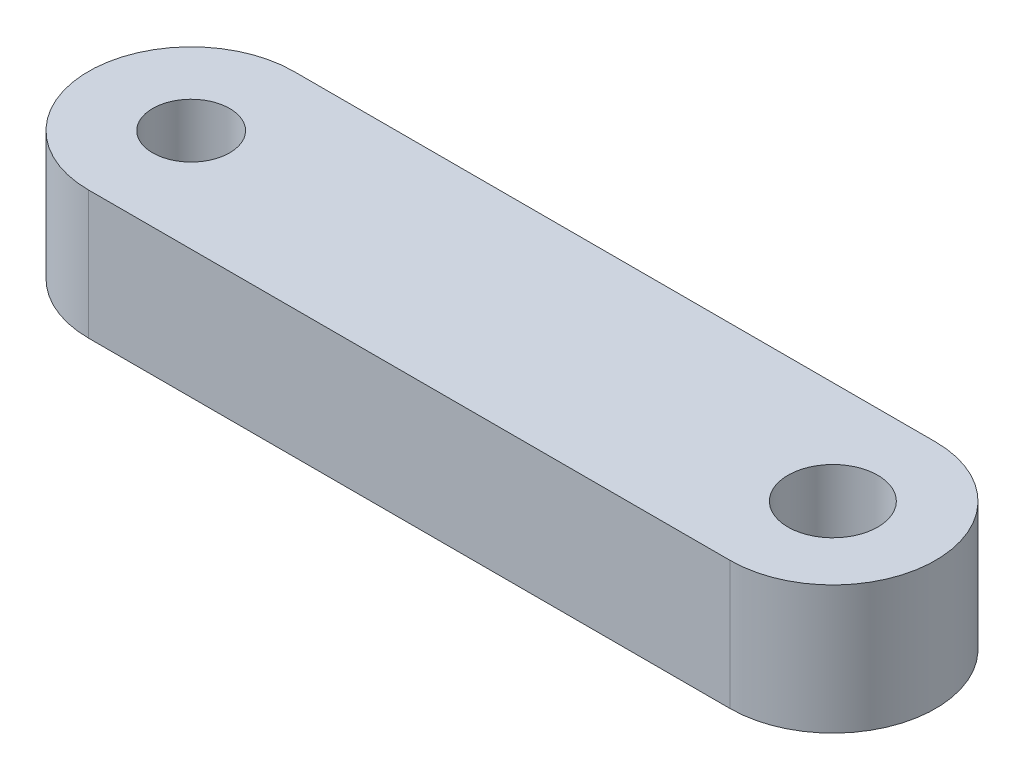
from build123d import *

# Parameters (mm, degrees)
CROQUIS1_R              = 3.5
CROQUIS1_R_2            = 3
SALIENTE_EXTRUIR1_DEPTH = 10


with BuildPart() as part:
    # Croquis1 → Saliente-Extruir1 (new body)
    with BuildSketch(Plane(origin=(0, 0, 0), x_dir=(1, 0, 0), z_dir=(0, 1, 0))):
        with BuildLine():
            Line((0, 8), (50, 8))
            ThreePointArc((50, 8), (58, 0), (50, -8))
            Line((50, -8), (0, -8))
            ThreePointArc((0, -8), (-8, 0), (0, 8))
        make_face()
        with Locations(Location((50, 0, 0), (0, 0, 270))):
            Circle(CROQUIS1_R, mode=Mode.SUBTRACT)
        with Locations(Location((0, 0, 0), (0, 0, 270))):
            Circle(CROQUIS1_R_2, mode=Mode.SUBTRACT)
    extrude(amount=SALIENTE_EXTRUIR1_DEPTH)


solid = part.part
